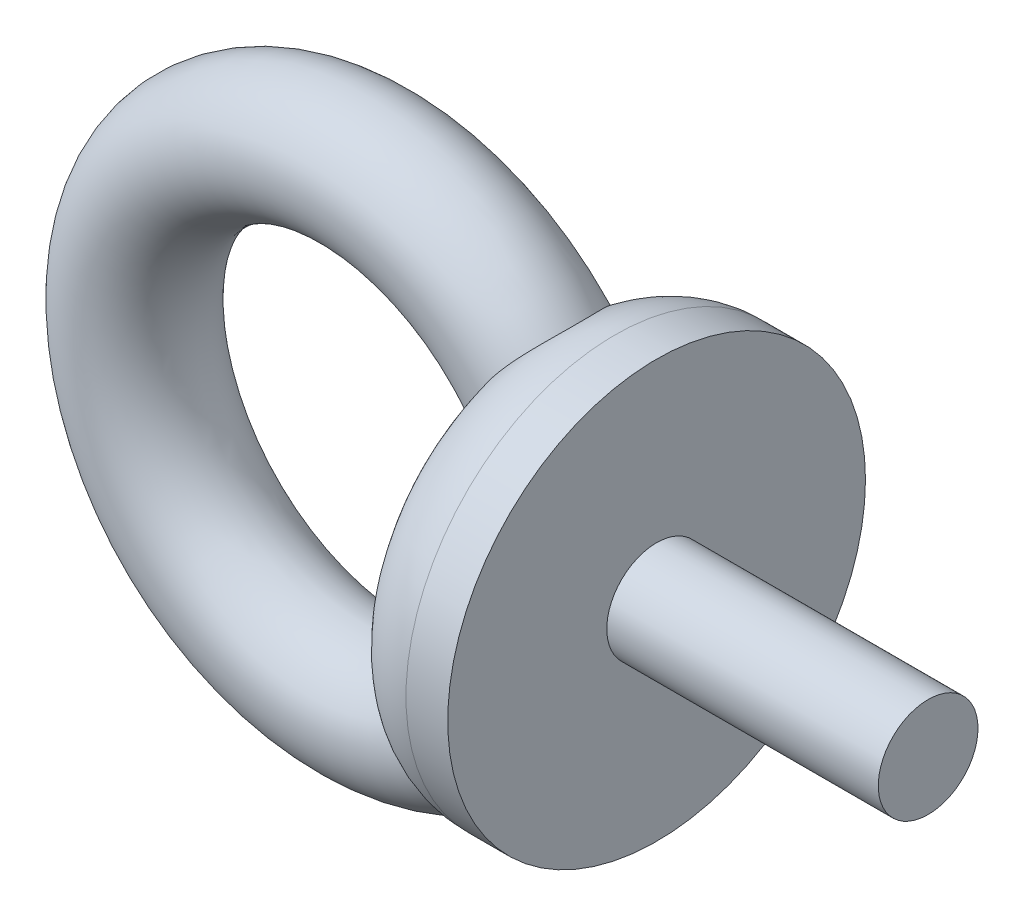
ISO-10303-21;
HEADER;
FILE_DESCRIPTION(('STEP AP214'),'2;1');
FILE_NAME('part.step','',(''),(''),'','','');
FILE_SCHEMA(('AUTOMOTIVE_DESIGN { 1 0 10303 214 1 1 1 1 }'));
ENDSEC;
DATA;
#1=APPLICATION_CONTEXT('core data for automotive mechanical design processes');
#2=APPLICATION_PROTOCOL_DEFINITION('international standard','automotive_design',2000,#1);
#3=PRODUCT_CONTEXT('',#1,'mechanical');
#4=PRODUCT('Part','Part','',(#3));
#5=PRODUCT_RELATED_PRODUCT_CATEGORY('part','',(#4));
#6=PRODUCT_DEFINITION_FORMATION('','',#4);
#7=PRODUCT_DEFINITION_CONTEXT('part definition',#1,'design');
#8=PRODUCT_DEFINITION('design','',#6,#7);
#9=PRODUCT_DEFINITION_SHAPE('','',#8);
#10=(LENGTH_UNIT() NAMED_UNIT(*) SI_UNIT(.MILLI.,.METRE.));
#11=(NAMED_UNIT(*) PLANE_ANGLE_UNIT() SI_UNIT($,.RADIAN.));
#12=(NAMED_UNIT(*) SI_UNIT($,.STERADIAN.) SOLID_ANGLE_UNIT());
#13=UNCERTAINTY_MEASURE_WITH_UNIT(LENGTH_MEASURE(1.E-05),#10,'distance_accuracy_value','');
#14=(GEOMETRIC_REPRESENTATION_CONTEXT(3) GLOBAL_UNCERTAINTY_ASSIGNED_CONTEXT((#13)) GLOBAL_UNIT_ASSIGNED_CONTEXT((#10,
#11,#12)) REPRESENTATION_CONTEXT('',''));
#15=CARTESIAN_POINT('',(0.,0.,0.));
#16=DIRECTION('',(0.,0.,1.));
#17=DIRECTION('',(1.,0.,0.));
#18=AXIS2_PLACEMENT_3D('',#15,#16,#17);
#19=CARTESIAN_POINT('',(0.,0.,0.));
#20=DIRECTION('',(0.,0.,-1.));
#21=DIRECTION('',(-1.,0.,0.));
#22=AXIS2_PLACEMENT_3D('',#19,#20,#21);
#23=TOROIDAL_SURFACE('',#22,11.,3.);
#24=CARTESIAN_POINT('',(8.,0.,0.));
#25=CARTESIAN_POINT('',(8.,0.85634513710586,-0.524401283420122));
#26=CARTESIAN_POINT('',(8.,1.28782894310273,-0.77932871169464));
#27=CARTESIAN_POINT('',(8.,2.00886347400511,-1.20532726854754));
#28=CARTESIAN_POINT('',(8.,2.59707188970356,-1.51559768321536));
#29=CARTESIAN_POINT('',(8.,3.31819010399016,-1.89597586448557));
#30=CARTESIAN_POINT('',(8.,3.94958075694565,-2.16454104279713));
#31=CARTESIAN_POINT('',(8.,4.68032640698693,-2.4753673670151));
#32=CARTESIAN_POINT('',(8.,5.37210425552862,-2.67217062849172));
#33=B_SPLINE_CURVE_WITH_KNOTS('',2,(#24,#25,#26,#27,#28,#29,#30,#31,#32),.UNSPECIFIED.,.F.,.F.,
(3,2,2,2,3),(0.,0.25,0.5,0.75,1.),.UNSPECIFIED.);
#34=CARTESIAN_POINT('',(8.,0.,0.));
#35=VERTEX_POINT('',#34);
#36=CARTESIAN_POINT('',(8.,5.37210425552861,-2.67217062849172));
#37=VERTEX_POINT('',#36);
#38=EDGE_CURVE('E151',#35,#37,#33,.T.);
#39=ORIENTED_EDGE('',*,*,#38,.F.);
#40=CARTESIAN_POINT('',(8.,5.37210425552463,2.67217062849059));
#41=CARTESIAN_POINT('',(8.,4.69332318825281,2.47906480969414));
#42=CARTESIAN_POINT('',(8.,3.96136122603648,2.16862069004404));
#43=CARTESIAN_POINT('',(8.,3.31947365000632,1.89637946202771));
#44=CARTESIAN_POINT('',(8.,2.6021967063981,1.5182999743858));
#45=CARTESIAN_POINT('',(8.,2.01320557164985,1.20784043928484));
#46=CARTESIAN_POINT('',(8.,1.28910346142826,0.780081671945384));
#47=CARTESIAN_POINT('',(8.,1.0016041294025,0.610243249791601));
#48=CARTESIAN_POINT('',(8.,0.642981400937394,0.392580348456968));
#49=CARTESIAN_POINT('',(8.,0.428795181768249,0.262581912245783));
#50=CARTESIAN_POINT('',(8.,0.,0.));
#51=B_SPLINE_CURVE_WITH_KNOTS('',2,(#40,#41,#42,#43,#44,#45,#46,#47,#48,#49,#50),.UNSPECIFIED.,
.F.,.F.,(3,2,2,2,2,3),(0.,0.25,0.5,0.75,0.875,1.),.UNSPECIFIED.);
#52=CARTESIAN_POINT('',(8.,5.37210425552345,2.67217062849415));
#53=VERTEX_POINT('',#52);
#54=EDGE_CURVE('E148',#53,#35,#51,.T.);
#55=ORIENTED_EDGE('',*,*,#54,.F.);
#56=CARTESIAN_POINT('',(8.,5.37210425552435,2.67217062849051));
#57=CARTESIAN_POINT('',(7.99998885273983,5.43690624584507,2.690605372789));
#58=CARTESIAN_POINT('',(8.00162054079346,5.50171347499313,2.70903674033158));
#59=CARTESIAN_POINT('',(8.00820594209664,5.63192295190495,2.74558258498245));
#60=CARTESIAN_POINT('',(8.01319149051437,5.69732492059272,2.7636923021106));
#61=CARTESIAN_POINT('',(8.0266067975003,5.82889383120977,2.79913573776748));
#62=CARTESIAN_POINT('',(8.03507973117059,5.89505987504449,2.81645659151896));
#63=CARTESIAN_POINT('',(8.05554604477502,6.02829410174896,2.84981806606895));
#64=CARTESIAN_POINT('',(8.0675923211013,6.09536024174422,2.86583447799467));
#65=CARTESIAN_POINT('',(8.09458871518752,6.22708064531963,2.89528562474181));
#66=CARTESIAN_POINT('',(8.10943048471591,6.29174178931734,2.90878786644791));
#67=CARTESIAN_POINT('',(8.13406435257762,6.38878090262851,2.92731754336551));
#68=CARTESIAN_POINT('',(8.14271607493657,6.42128439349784,2.93322991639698));
#69=CARTESIAN_POINT('',(8.16084251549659,6.4864143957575,2.94443726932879));
#70=CARTESIAN_POINT('',(8.17032243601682,6.5190402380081,2.94972777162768));
#71=CARTESIAN_POINT('',(8.19010691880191,6.58440983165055,2.95962967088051));
#72=CARTESIAN_POINT('',(8.20041698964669,6.61715270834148,2.96423583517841));
#73=CARTESIAN_POINT('',(8.22186095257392,6.68274987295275,2.97270632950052));
#74=CARTESIAN_POINT('',(8.23300061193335,6.7156030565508,2.97656463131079));
#75=CARTESIAN_POINT('',(8.25610143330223,6.7814104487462,2.98347540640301));
#76=CARTESIAN_POINT('',(8.26806857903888,6.81436327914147,2.98652101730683));
#77=CARTESIAN_POINT('',(8.29281847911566,6.88035703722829,2.99174135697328));
#78=CARTESIAN_POINT('',(8.30560737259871,6.91339627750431,2.99390835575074));
#79=CARTESIAN_POINT('',(8.33106923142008,6.97721545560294,2.99718612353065));
#80=CARTESIAN_POINT('',(8.34370068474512,7.00800904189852,2.99835380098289));
#81=CARTESIAN_POINT('',(8.36967755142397,7.06967758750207,2.99982531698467));
#82=CARTESIAN_POINT('',(8.38302883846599,7.10055028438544,3.00012040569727));
#83=CARTESIAN_POINT('',(8.41043420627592,7.16235823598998,2.99978911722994));
#84=CARTESIAN_POINT('',(8.42449410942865,7.19329085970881,2.9991532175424));
#85=CARTESIAN_POINT('',(8.45330490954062,7.25519621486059,2.99690202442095));
#86=CARTESIAN_POINT('',(8.46806154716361,7.28616590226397,2.99527643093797));
#87=CARTESIAN_POINT('',(8.49825143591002,7.34811971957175,2.9909877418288));
#88=CARTESIAN_POINT('',(8.51369029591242,7.37910035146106,2.98831356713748));
#89=CARTESIAN_POINT('',(8.54522799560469,7.44104699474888,2.98186964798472));
#90=CARTESIAN_POINT('',(8.56133226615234,7.47200901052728,2.97808804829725));
#91=CARTESIAN_POINT('',(8.59418193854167,7.53388560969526,2.96937146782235));
#92=CARTESIAN_POINT('',(8.61093254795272,7.56479565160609,2.96442386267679));
#93=CARTESIAN_POINT('',(8.64505269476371,7.62653275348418,2.95331795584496));
#94=CARTESIAN_POINT('',(8.66242715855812,7.65735468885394,2.94714627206));
#95=CARTESIAN_POINT('',(8.69593390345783,7.71567142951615,2.93424397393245));
#96=CARTESIAN_POINT('',(8.71203168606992,7.74320938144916,2.92761850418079));
#97=CARTESIAN_POINT('',(8.7447683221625,7.79830074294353,2.91326936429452));
#98=CARTESIAN_POINT('',(8.76141171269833,7.82584731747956,2.90552978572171));
#99=CARTESIAN_POINT('',(8.79521282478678,7.88092100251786,2.88889815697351));
#100=CARTESIAN_POINT('',(8.81237451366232,7.90844069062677,2.87998958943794));
#101=CARTESIAN_POINT('',(8.84718391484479,7.96342200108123,2.86096633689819));
#102=CARTESIAN_POINT('',(8.86483500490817,7.99087557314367,2.85083456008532));
#103=CARTESIAN_POINT('',(8.90059190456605,8.04568270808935,2.82931227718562));
#104=CARTESIAN_POINT('',(8.91870046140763,8.07302755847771,2.81790414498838));
#105=CARTESIAN_POINT('',(8.95533820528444,8.12757188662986,2.79377781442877));
#106=CARTESIAN_POINT('',(8.97386947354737,8.1547619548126,2.78104149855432));
#107=CARTESIAN_POINT('',(9.01131580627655,8.20894756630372,2.75420909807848));
#108=CARTESIAN_POINT('',(9.03023225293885,8.23593296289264,2.7400944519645));
#109=CARTESIAN_POINT('',(9.06840841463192,8.28965763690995,2.71045748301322));
#110=CARTESIAN_POINT('',(9.08766876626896,8.31638601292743,2.69491620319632));
#111=CARTESIAN_POINT('',(9.12375534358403,8.36579088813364,2.66467411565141));
#112=CARTESIAN_POINT('',(9.1405823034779,8.38855337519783,2.65011438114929));
#113=CARTESIAN_POINT('',(9.17459153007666,8.43404588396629,2.61973812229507));
#114=CARTESIAN_POINT('',(9.19177272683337,8.45676225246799,2.60389994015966));
#115=CARTESIAN_POINT('',(9.22644574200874,8.50211374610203,2.57091487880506));
#116=CARTESIAN_POINT('',(9.24393542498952,8.5247345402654,2.55374605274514));
#117=CARTESIAN_POINT('',(9.27917838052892,8.56984204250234,2.5180493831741));
#118=CARTESIAN_POINT('',(9.29692846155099,8.59231369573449,2.49949936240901));
#119=CARTESIAN_POINT('',(9.33264143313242,8.63706646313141,2.46099226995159));
#120=CARTESIAN_POINT('',(9.35060005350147,8.65933176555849,2.44101286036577));
#121=CARTESIAN_POINT('',(9.38667578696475,8.70361172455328,2.39960155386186));
#122=CARTESIAN_POINT('',(9.40478753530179,8.72560978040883,2.37814722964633));
#123=CARTESIAN_POINT('',(9.44111180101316,8.76929102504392,2.33374384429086));
#124=CARTESIAN_POINT('',(9.45931784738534,8.79095678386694,2.3107723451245));
#125=CARTESIAN_POINT('',(9.4957684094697,8.83390702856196,2.26329553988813));
#126=CARTESIAN_POINT('',(9.51400531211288,8.85517325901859,2.23876785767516));
#127=CARTESIAN_POINT('',(9.54688177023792,8.89312368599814,2.19310785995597));
#128=CARTESIAN_POINT('',(9.56158683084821,8.90995277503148,2.17214277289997));
#129=CARTESIAN_POINT('',(9.5912207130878,8.94360289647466,2.12875474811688));
#130=CARTESIAN_POINT('',(9.60613819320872,8.96040133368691,2.10630652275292));
#131=CARTESIAN_POINT('',(9.63612758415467,8.99392246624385,2.05989927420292));
#132=CARTESIAN_POINT('',(9.65118646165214,9.01062170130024,2.03591488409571));
#133=CARTESIAN_POINT('',(9.68138565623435,9.04387125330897,1.98638504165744));
#134=CARTESIAN_POINT('',(9.6965112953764,9.06039714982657,1.96081424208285));
#135=CARTESIAN_POINT('',(9.72676568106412,9.09322216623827,1.90806518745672));
#136=CARTESIAN_POINT('',(9.7418780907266,9.10949584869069,1.88086173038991));
#137=CARTESIAN_POINT('',(9.77202258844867,9.14173382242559,1.82480537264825));
#138=CARTESIAN_POINT('',(9.78703667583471,9.15767160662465,1.79592754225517));
#139=CARTESIAN_POINT('',(9.81689640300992,9.18914966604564,1.73648595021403));
#140=CARTESIAN_POINT('',(9.83172238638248,9.20466229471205,1.70589767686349));
#141=CARTESIAN_POINT('',(9.86111091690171,9.23519971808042,1.64300393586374));
#142=CARTESIAN_POINT('',(9.8756520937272,9.25019576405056,1.61067449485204));
#143=CARTESIAN_POINT('',(9.90002014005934,9.27513504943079,1.55434985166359));
#144=CARTESIAN_POINT('',(9.91003183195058,9.28532210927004,1.53054186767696));
#145=CARTESIAN_POINT('',(9.93032285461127,9.30586605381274,1.48085532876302));
#146=CARTESIAN_POINT('',(9.94057179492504,9.31618483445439,1.45494856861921));
#147=CARTESIAN_POINT('',(9.96122025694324,9.33688283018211,1.40100324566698));
#148=CARTESIAN_POINT('',(9.97158569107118,9.34722175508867,1.37293617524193));
#149=CARTESIAN_POINT('',(9.99234126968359,9.36783960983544,1.31461281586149));
#150=CARTESIAN_POINT('',(10.0026937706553,9.37807578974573,1.28432800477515));
#151=CARTESIAN_POINT('',(10.0232867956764,9.39835771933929,1.22151811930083));
#152=CARTESIAN_POINT('',(10.0334861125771,9.40835810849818,1.18896487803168));
#153=CARTESIAN_POINT('',(10.0536236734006,9.42802974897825,1.12157507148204));
#154=CARTESIAN_POINT('',(10.0635170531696,9.43765300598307,1.08671107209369));
#155=CARTESIAN_POINT('',(10.0828898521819,9.45641391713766,1.0146674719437));
#156=CARTESIAN_POINT('',(10.0923211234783,9.4655004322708,0.977461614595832));
#157=CARTESIAN_POINT('',(10.1105775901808,9.48305263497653,0.900712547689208));
#158=CARTESIAN_POINT('',(10.1193499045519,9.49146555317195,0.861144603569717));
#159=CARTESIAN_POINT('',(10.131830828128,9.50326825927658,0.80079980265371));
#160=CARTESIAN_POINT('',(10.1359359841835,9.50711908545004,0.780193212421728));
#161=CARTESIAN_POINT('',(10.144055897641,9.51474155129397,0.737636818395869));
#162=CARTESIAN_POINT('',(10.1480508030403,9.51849490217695,0.715679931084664));
#163=CARTESIAN_POINT('',(10.1570216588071,9.52691970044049,0.663897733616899));
#164=CARTESIAN_POINT('',(10.1618479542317,9.53144926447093,0.634023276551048));
#165=CARTESIAN_POINT('',(10.172001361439,9.54097855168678,0.566283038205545));
#166=CARTESIAN_POINT('',(10.1771317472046,9.54579367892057,0.528361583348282));
#167=CARTESIAN_POINT('',(10.1872724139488,9.55531030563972,0.444417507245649));
#168=CARTESIAN_POINT('',(10.192039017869,9.55978291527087,0.398339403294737));
#169=CARTESIAN_POINT('',(10.2006861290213,9.56789642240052,0.298015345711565));
#170=CARTESIAN_POINT('',(10.2042752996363,9.57126390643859,0.243721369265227));
#171=CARTESIAN_POINT('',(10.2081751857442,9.57492266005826,0.159164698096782));
#172=CARTESIAN_POINT('',(10.209234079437,9.57591600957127,0.12896289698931));
#173=CARTESIAN_POINT('',(10.2107334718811,9.57732245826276,0.0665378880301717));
#174=CARTESIAN_POINT('',(10.2111286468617,9.57769303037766,0.0343125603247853));
#175=CARTESIAN_POINT('',(10.211161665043,9.5777236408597,-0.0304141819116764));
#176=CARTESIAN_POINT('',(10.2107930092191,9.57737758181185,-0.0629156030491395));
#177=CARTESIAN_POINT('',(10.2093328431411,9.57600730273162,-0.125855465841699));
#178=CARTESIAN_POINT('',(10.2082879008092,9.57502677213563,-0.156296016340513));
#179=CARTESIAN_POINT('',(10.2044153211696,9.57139296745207,-0.241455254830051));
#180=CARTESIAN_POINT('',(10.2008302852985,9.56802903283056,-0.29611324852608));
#181=CARTESIAN_POINT('',(10.1921723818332,9.55990513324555,-0.397011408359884));
#182=CARTESIAN_POINT('',(10.1873981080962,9.5554253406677,-0.443300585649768));
#183=CARTESIAN_POINT('',(10.1772440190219,9.54589641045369,-0.527514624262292));
#184=CARTESIAN_POINT('',(10.1721133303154,9.54108123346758,-0.56549609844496));
#185=CARTESIAN_POINT('',(10.1619764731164,9.5315685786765,-0.633207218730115));
#186=CARTESIAN_POINT('',(10.1571707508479,9.52705904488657,-0.662993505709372));
#187=CARTESIAN_POINT('',(10.1482686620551,9.51869997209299,-0.714453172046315));
#188=CARTESIAN_POINT('',(10.1443238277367,9.51499412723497,-0.736176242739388));
#189=CARTESIAN_POINT('',(10.1364385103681,9.50759518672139,-0.777593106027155));
#190=CARTESIAN_POINT('',(10.1325280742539,9.50392955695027,-0.797297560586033));
#191=CARTESIAN_POINT('',(10.1203057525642,9.49237932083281,-0.85671677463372));
#192=CARTESIAN_POINT('',(10.1115876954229,9.48401865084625,-0.896257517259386));
#193=CARTESIAN_POINT('',(10.0934381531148,9.46657332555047,-0.972953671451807));
#194=CARTESIAN_POINT('',(10.0840596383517,9.45754134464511,-1.01013369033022));
#195=CARTESIAN_POINT('',(10.0647923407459,9.43888992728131,-1.08212697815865));
#196=CARTESIAN_POINT('',(10.0549517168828,9.42932161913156,-1.11696637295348));
#197=CARTESIAN_POINT('',(10.0349191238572,9.40976064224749,-1.18430809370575));
#198=CARTESIAN_POINT('',(10.02477205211,9.39981593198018,-1.21683772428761));
#199=CARTESIAN_POINT('',(10.0042829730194,9.3796459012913,-1.27960127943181));
#200=CARTESIAN_POINT('',(9.99398220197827,9.36946590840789,-1.30986324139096));
#201=CARTESIAN_POINT('',(9.97332940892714,9.34896089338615,-1.36814154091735));
#202=CARTESIAN_POINT('',(9.96301506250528,9.33867858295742,-1.3961862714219));
#203=CARTESIAN_POINT('',(9.94246801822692,9.31809416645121,-1.45008728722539));
#204=CARTESIAN_POINT('',(9.93226944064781,9.3078323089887,-1.47597195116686));
#205=CARTESIAN_POINT('',(9.91207825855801,9.28740249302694,-1.52561439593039));
#206=CARTESIAN_POINT('',(9.90211608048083,9.27727259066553,-1.54940025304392));
#207=CARTESIAN_POINT('',(9.87786734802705,9.25247268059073,-1.60567465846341));
#208=CARTESIAN_POINT('',(9.8633962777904,9.23755986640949,-1.63797739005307));
#209=CARTESIAN_POINT('',(9.8341467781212,9.20719017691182,-1.70082475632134));
#210=CARTESIAN_POINT('',(9.81938968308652,9.19176192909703,-1.73139318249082));
#211=CARTESIAN_POINT('',(9.78966609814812,9.16045349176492,-1.79080177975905));
#212=CARTESIAN_POINT('',(9.77471924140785,9.14460083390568,-1.81966628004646));
#213=CARTESIAN_POINT('',(9.74470719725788,9.11253355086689,-1.87570230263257));
#214=CARTESIAN_POINT('',(9.72965999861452,9.09634532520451,-1.90289857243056));
#215=CARTESIAN_POINT('',(9.69953368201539,9.06369128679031,-1.95563917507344));
#216=CARTESIAN_POINT('',(9.68447090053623,9.0472508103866,-1.98120852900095));
#217=CARTESIAN_POINT('',(9.65439475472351,9.01417183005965,-2.03074097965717));
#218=CARTESIAN_POINT('',(9.63939607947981,8.99755765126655,-2.05472924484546));
#219=CARTESIAN_POINT('',(9.60952417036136,8.96420604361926,-2.10114930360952));
#220=CARTESIAN_POINT('',(9.59466399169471,8.947491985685,-2.12360628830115));
#221=CARTESIAN_POINT('',(9.56514148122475,8.91400983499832,-2.16701644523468));
#222=CARTESIAN_POINT('',(9.55049052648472,8.89726425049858,-2.18799473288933));
#223=CARTESIAN_POINT('',(9.51768115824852,8.85944159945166,-2.23376082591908));
#224=CARTESIAN_POINT('',(9.49945579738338,8.83821753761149,-2.25837952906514));
#225=CARTESIAN_POINT('',(9.46302469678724,8.79534865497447,-2.30603654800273));
#226=CARTESIAN_POINT('',(9.44482665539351,8.77372215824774,-2.32909724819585));
#227=CARTESIAN_POINT('',(9.40851494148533,8.73011673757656,-2.373677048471));
#228=CARTESIAN_POINT('',(9.39040782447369,8.70815530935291,-2.39521859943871));
#229=CARTESIAN_POINT('',(9.35433815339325,8.66394609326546,-2.43680222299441));
#230=CARTESIAN_POINT('',(9.33638104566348,8.64171497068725,-2.45686674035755));
#231=CARTESIAN_POINT('',(9.30066812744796,8.59702825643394,-2.49554178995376));
#232=CARTESIAN_POINT('',(9.28291666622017,8.57458853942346,-2.51417468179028));
#233=CARTESIAN_POINT('',(9.24766819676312,8.52954280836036,-2.55003473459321));
#234=CARTESIAN_POINT('',(9.23017445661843,8.50695191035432,-2.56728409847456));
#235=CARTESIAN_POINT('',(9.19549081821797,8.4616582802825,-2.60042779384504));
#236=CARTESIAN_POINT('',(9.17830312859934,8.43896993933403,-2.61634410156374));
#237=CARTESIAN_POINT('',(9.14427851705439,8.3935318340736,-2.64687411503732));
#238=CARTESIAN_POINT('',(9.12744273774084,8.37079577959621,-2.66150951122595));
#239=CARTESIAN_POINT('',(9.09128276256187,8.32137490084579,-2.69195699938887));
#240=CARTESIAN_POINT('',(9.07195740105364,8.29460183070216,-2.70762475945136));
#241=CARTESIAN_POINT('',(9.03365018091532,8.24078285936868,-2.73750505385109));
#242=CARTESIAN_POINT('',(9.01466772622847,8.21374798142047,-2.75173669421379));
#243=CARTESIAN_POINT('',(8.97708869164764,8.15945917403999,-2.77879365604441));
#244=CARTESIAN_POINT('',(8.95849076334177,8.13221550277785,-2.79163768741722));
#245=CARTESIAN_POINT('',(8.92171948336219,8.07756027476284,-2.8159702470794));
#246=CARTESIAN_POINT('',(8.90354407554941,8.05015823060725,-2.82747704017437));
#247=CARTESIAN_POINT('',(8.86765366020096,7.99523354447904,-2.84918770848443));
#248=CARTESIAN_POINT('',(8.84993592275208,7.96771970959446,-2.85940935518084));
#249=CARTESIAN_POINT('',(8.81499378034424,7.91261520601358,-2.87860370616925));
#250=CARTESIAN_POINT('',(8.79776600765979,7.88503267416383,-2.88759364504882));
#251=CARTESIAN_POINT('',(8.76383366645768,7.82983106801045,-2.90437969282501));
#252=CARTESIAN_POINT('',(8.74712513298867,7.80221949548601,-2.91219245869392));
#253=CARTESIAN_POINT('',(8.71425932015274,7.74699640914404,-2.92668000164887));
#254=CARTESIAN_POINT('',(8.69809750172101,7.71939180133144,-2.93337082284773));
#255=CARTESIAN_POINT('',(8.66449412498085,7.66099640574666,-2.94638915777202));
#256=CARTESIAN_POINT('',(8.64708627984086,7.63016312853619,-2.95261337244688));
#257=CARTESIAN_POINT('',(8.61289883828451,7.56840027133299,-2.96382096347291));
#258=CARTESIAN_POINT('',(8.59611433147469,7.53747583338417,-2.96881772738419));
#259=CARTESIAN_POINT('',(8.56319627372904,7.47556767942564,-2.97762920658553));
#260=CARTESIAN_POINT('',(8.54705753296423,7.44458851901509,-2.98145655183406));
#261=CARTESIAN_POINT('',(8.51545043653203,7.38260500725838,-2.98798850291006));
#262=CARTESIAN_POINT('',(8.49997666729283,7.35160466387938,-2.99070496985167));
#263=CARTESIAN_POINT('',(8.46971658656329,7.28960905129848,-2.99507476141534));
#264=CARTESIAN_POINT('',(8.45492468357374,7.25861729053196,-2.99673917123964));
#265=CARTESIAN_POINT('',(8.42604305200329,7.19666561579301,-2.99906450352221));
#266=CARTESIAN_POINT('',(8.4119476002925,7.16570875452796,-2.99973573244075));
#267=CARTESIAN_POINT('',(8.38447097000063,7.10385032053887,-3.00013418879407));
#268=CARTESIAN_POINT('',(8.37108398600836,7.07295138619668,-2.99987094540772));
#269=CARTESIAN_POINT('',(8.34503543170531,7.01122862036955,-2.99845963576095));
#270=CARTESIAN_POINT('',(8.3323680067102,6.98040705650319,-2.99732032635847));
#271=CARTESIAN_POINT('',(8.3068348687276,6.91653495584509,-2.99409823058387));
#272=CARTESIAN_POINT('',(8.29401057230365,6.88347072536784,-2.99195850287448));
#273=CARTESIAN_POINT('',(8.26919081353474,6.81742438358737,-2.98678924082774));
#274=CARTESIAN_POINT('',(8.25718923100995,6.78444396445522,-2.9837674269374));
#275=CARTESIAN_POINT('',(8.23402029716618,6.71857906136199,-2.97690080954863));
#276=CARTESIAN_POINT('',(8.22284698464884,6.68569595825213,-2.97306285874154));
#277=CARTESIAN_POINT('',(8.20133656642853,6.62003677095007,-2.96462967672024));
#278=CARTESIAN_POINT('',(8.19099371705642,6.58726179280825,-2.96004046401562));
#279=CARTESIAN_POINT('',(8.17114451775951,6.52182598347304,-2.95016912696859));
#280=CARTESIAN_POINT('',(8.16163268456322,6.48916602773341,-2.94489222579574));
#281=CARTESIAN_POINT('',(8.14344334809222,6.42396591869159,-2.93370880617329));
#282=CARTESIAN_POINT('',(8.1347606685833,6.39142643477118,-2.92780675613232));
#283=CARTESIAN_POINT('',(8.11003470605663,6.29427500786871,-2.90930269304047));
#284=CARTESIAN_POINT('',(8.09513327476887,6.22953682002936,-2.89581131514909));
#285=CARTESIAN_POINT('',(8.06799774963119,6.09754067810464,-2.86634538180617));
#286=CARTESIAN_POINT('',(8.05587810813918,6.03027541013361,-2.85029927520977));
#287=CARTESIAN_POINT('',(8.03528808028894,5.89664392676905,-2.8168651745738));
#288=CARTESIAN_POINT('',(8.02676447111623,5.83027978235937,-2.79950159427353));
#289=CARTESIAN_POINT('',(8.01326919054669,5.69831513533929,-2.76396390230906));
#290=CARTESIAN_POINT('',(8.00825414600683,5.63271553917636,-2.74580274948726));
#291=CARTESIAN_POINT('',(8.0016298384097,5.50211006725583,-2.70914926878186));
#292=CARTESIAN_POINT('',(7.99998867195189,5.4371044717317,-2.69066172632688));
#293=CARTESIAN_POINT('',(8.00000000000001,5.37210425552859,-2.67217062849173));
#294=B_SPLINE_CURVE_WITH_KNOTS('',3,(#56,#57,#58,#59,#60,#61,#62,#63,#64,#65,#66,#67,#68,#69,
#70,#71,#72,#73,#74,#75,#76,#77,#78,#79,#80,#81,#82,#83,#84,#85,#86,#87,#88,#89,#90,#91,#92,#93,
#94,#95,#96,#97,#98,#99,#100,#101,#102,#103,#104,#105,#106,#107,#108,#109,#110,#111,#112,#113,
#114,#115,#116,#117,#118,#119,#120,#121,#122,#123,#124,#125,#126,#127,#128,#129,#130,#131,#132,
#133,#134,#135,#136,#137,#138,#139,#140,#141,#142,#143,#144,#145,#146,#147,#148,#149,#150,#151,
#152,#153,#154,#155,#156,#157,#158,#159,#160,#161,#162,#163,#164,#165,#166,#167,#168,#169,#170,
#171,#172,#173,#174,#175,#176,#177,#178,#179,#180,#181,#182,#183,#184,#185,#186,#187,#188,#189,
#190,#191,#192,#193,#194,#195,#196,#197,#198,#199,#200,#201,#202,#203,#204,#205,#206,#207,#208,
#209,#210,#211,#212,#213,#214,#215,#216,#217,#218,#219,#220,#221,#222,#223,#224,#225,#226,#227,
#228,#229,#230,#231,#232,#233,#234,#235,#236,#237,#238,#239,#240,#241,#242,#243,#244,#245,#246,
#247,#248,#249,#250,#251,#252,#253,#254,#255,#256,#257,#258,#259,#260,#261,#262,#263,#264,#265,
#266,#267,#268,#269,#270,#271,#272,#273,#274,#275,#276,#277,#278,#279,#280,#281,#282,#283,#284,
#285,#286,#287,#288,#289,#290,#291,#292,#293),.UNSPECIFIED.,.F.,.F.,(4,2,2,2,2,2,2,2,2,2,2,2,2,
2,2,2,2,2,2,2,2,2,2,2,2,2,2,2,2,2,2,2,2,2,2,2,2,2,2,2,2,2,2,2,2,2,2,2,2,2,2,2,2,2,2,2,2,2,2,2,2,
2,2,2,2,2,2,2,2,2,2,2,2,2,2,2,2,2,2,2,2,2,2,2,2,2,2,2,2,2,2,2,2,2,2,2,2,2,2,2,2,2,2,2,2,2,2,2,2,
2,2,2,2,2,2,2,2,2,4),(0.,0.202105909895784,0.406157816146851,0.612815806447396,
0.822700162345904,1.02569222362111,1.12813255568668,1.23127035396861,1.33516013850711,
1.43985536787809,1.54540851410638,1.65187114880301,1.75176657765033,1.85266036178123,
1.95459336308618,2.05760579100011,2.1617372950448,2.26702705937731,2.37351389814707,
2.48123635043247,2.57895417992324,2.67823917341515,2.77911922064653,2.88162151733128,
2.98577265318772,3.0915986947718,3.1991252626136,3.3083776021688,3.40385564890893,
3.50160495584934,3.60164085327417,3.70397795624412,3.80863024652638,3.91561114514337,
4.0249335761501,4.13661002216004,4.22852437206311,4.32378470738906,4.4223967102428,
4.52436558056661,4.6296961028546,4.73839270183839,4.85045948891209,4.96590030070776,
5.04918178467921,5.13829795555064,5.23324975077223,5.3340379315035,5.44066312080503,
5.5531258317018,5.67142648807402,5.79556544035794,5.85964580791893,5.92753231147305,
6.01931479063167,6.13499178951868,6.2745614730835,6.43802162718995,6.52872015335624,
6.62539247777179,6.72289071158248,6.81430171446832,6.9788462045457,7.11904662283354,
7.23490065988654,7.32640640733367,7.39356235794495,7.4548201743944,7.57881487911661,
7.69696719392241,7.80927745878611,7.91574608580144,8.01637357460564,8.11116053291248,
8.20010770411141,8.28321600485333,8.39841320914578,8.51024456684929,8.61871384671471,
8.723825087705,8.82558263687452,8.92399119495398,9.01905587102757,9.11078224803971,
9.22254966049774,9.33195904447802,9.43902281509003,9.54375382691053,9.64616542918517,
9.74627152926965,9.84408666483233,9.93962608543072,10.0492418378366,10.1571228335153,
10.26329447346,10.3677825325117,10.4706132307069,10.5718133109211,10.6714101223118,
10.7694317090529,10.8772589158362,10.983851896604,11.0892492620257,11.1934898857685,
11.2966129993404,11.3986582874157,11.4996659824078,11.5996769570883,11.7062426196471,
11.8119021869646,11.9167073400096,12.0207106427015,12.1239656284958,12.2265268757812,
12.4297720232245,12.6402859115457,12.8475644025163,13.0522329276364,13.2549570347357),.UNSPECIFIED.);
#295=EDGE_CURVE('E11',#53,#37,#294,.T.);
#296=ORIENTED_EDGE('',*,*,#295,.T.);
#297=EDGE_LOOP('',(#39,#55,#296));
#298=FACE_BOUND('',#297,.T.);
#299=CARTESIAN_POINT('',(8.,0.,0.));
#300=CARTESIAN_POINT('',(8.,-0.856345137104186,0.524401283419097));
#301=CARTESIAN_POINT('',(8.,-1.28782894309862,0.779328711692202));
#302=CARTESIAN_POINT('',(8.,-2.00886347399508,1.20532726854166));
#303=CARTESIAN_POINT('',(8.,-2.59707188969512,1.5155976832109));
#304=CARTESIAN_POINT('',(8.,-3.31819010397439,1.89597586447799));
#305=CARTESIAN_POINT('',(8.,-3.94958075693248,2.16454104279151));
#306=CARTESIAN_POINT('',(8.,-4.68032640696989,2.47536736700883));
#307=CARTESIAN_POINT('',(8.,-5.37210425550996,2.67217062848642));
#308=B_SPLINE_CURVE_WITH_KNOTS('',2,(#299,#300,#301,#302,#303,#304,#305,#306,#307),
.UNSPECIFIED.,.F.,.F.,(3,2,2,2,3),(0.,0.25,0.5,0.75,1.),.UNSPECIFIED.);
#309=CARTESIAN_POINT('',(8.,-5.37210425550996,2.67217062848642));
#310=VERTEX_POINT('',#309);
#311=EDGE_CURVE('E35',#35,#310,#308,.T.);
#312=ORIENTED_EDGE('',*,*,#311,.F.);
#313=CARTESIAN_POINT('',(8.,-5.37210425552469,-2.67217062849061));
#314=CARTESIAN_POINT('',(8.,-4.69332318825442,-2.4790648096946));
#315=CARTESIAN_POINT('',(8.,-3.96136122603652,-2.16862069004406));
#316=CARTESIAN_POINT('',(8.,-3.31947365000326,-1.89637946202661));
#317=CARTESIAN_POINT('',(8.,-2.60219670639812,-1.51829997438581));
#318=CARTESIAN_POINT('',(8.,-2.01320557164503,-1.20784043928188));
#319=CARTESIAN_POINT('',(8.,-1.28910346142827,-0.780081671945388));
#320=CARTESIAN_POINT('',(8.,-1.00160412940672,-0.610243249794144));
#321=CARTESIAN_POINT('',(8.,-0.642981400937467,-0.392580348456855));
#322=CARTESIAN_POINT('',(8.,-0.428795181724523,-0.262581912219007));
#323=CARTESIAN_POINT('',(8.,0.,0.));
#324=B_SPLINE_CURVE_WITH_KNOTS('',2,(#313,#314,#315,#316,#317,#318,#319,#320,#321,#322,#323),
.UNSPECIFIED.,.F.,.F.,(3,2,2,2,2,3),(0.,0.25,0.5,0.75,0.875,1.),.UNSPECIFIED.);
#325=CARTESIAN_POINT('',(8.,-5.37210425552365,-2.67217062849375));
#326=VERTEX_POINT('',#325);
#327=EDGE_CURVE('E155',#326,#35,#324,.T.);
#328=ORIENTED_EDGE('',*,*,#327,.F.);
#329=CARTESIAN_POINT('',(8.00000000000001,-5.37210425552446,-2.67217062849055));
#330=CARTESIAN_POINT('',(7.99998848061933,-5.43745215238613,-2.69076066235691));
#331=CARTESIAN_POINT('',(8.00164758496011,-5.50280550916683,-2.7093471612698));
#332=CARTESIAN_POINT('',(8.00834414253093,-5.63411572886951,-2.74619332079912));
#333=CARTESIAN_POINT('',(8.0134141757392,-5.70007230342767,-2.76444806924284));
#334=CARTESIAN_POINT('',(8.02705773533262,-5.83276274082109,-2.80015977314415));
#335=CARTESIAN_POINT('',(8.03567555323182,-5.8994956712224,-2.81760342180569));
#336=CARTESIAN_POINT('',(8.05649222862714,-6.03387860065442,-2.85117541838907));
#337=CARTESIAN_POINT('',(8.06874539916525,-6.10152647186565,-2.86727869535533));
#338=CARTESIAN_POINT('',(8.09618807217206,-6.2343107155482,-2.8968319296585));
#339=CARTESIAN_POINT('',(8.11126385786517,-6.29945443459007,-2.91035336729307));
#340=CARTESIAN_POINT('',(8.13628206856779,-6.39721534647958,-2.92887207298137));
#341=CARTESIAN_POINT('',(8.14506871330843,-6.42996202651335,-2.93477429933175));
#342=CARTESIAN_POINT('',(8.16347681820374,-6.4955795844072,-2.94594683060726));
#343=CARTESIAN_POINT('',(8.17310361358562,-6.52844976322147,-2.95121250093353));
#344=CARTESIAN_POINT('',(8.19319353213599,-6.59430879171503,-2.96104877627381));
#345=CARTESIAN_POINT('',(8.20366230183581,-6.62729672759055,-2.96561396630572));
#346=CARTESIAN_POINT('',(8.22543512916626,-6.69338429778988,-2.9739851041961));
#347=CARTESIAN_POINT('',(8.23674509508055,-6.7264827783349,-2.97778481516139));
#348=CARTESIAN_POINT('',(8.26019772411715,-6.79278044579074,-2.98455953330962));
#349=CARTESIAN_POINT('',(8.27234651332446,-6.82597819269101,-2.9875274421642));
#350=CARTESIAN_POINT('',(8.297470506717,-6.89246077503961,-2.99257202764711));
#351=CARTESIAN_POINT('',(8.31045199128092,-6.92574384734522,-2.99464071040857));
#352=CARTESIAN_POINT('',(8.33628212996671,-6.98999813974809,-2.99770610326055));
#353=CARTESIAN_POINT('',(8.34908823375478,-7.02098366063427,-2.99876180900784));
#354=CARTESIAN_POINT('',(8.37542288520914,-7.08303667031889,-2.99999111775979));
#355=CARTESIAN_POINT('',(8.38895745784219,-7.1141017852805,-3.00015563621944));
#356=CARTESIAN_POINT('',(8.41673732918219,-7.17629440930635,-2.99954363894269));
#357=CARTESIAN_POINT('',(8.4309885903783,-7.20741915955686,-2.99875724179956));
#358=CARTESIAN_POINT('',(8.46018945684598,-7.26970772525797,-2.99618418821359));
#359=CARTESIAN_POINT('',(8.47514493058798,-7.30086835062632,-2.99438684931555));
#360=CARTESIAN_POINT('',(8.50573916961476,-7.36320201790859,-2.9897325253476));
#361=CARTESIAN_POINT('',(8.52138365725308,-7.39437139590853,-2.98686405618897));
#362=CARTESIAN_POINT('',(8.55333853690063,-7.45669241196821,-2.98000815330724));
#363=CARTESIAN_POINT('',(8.56965445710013,-7.48783986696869,-2.97600843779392));
#364=CARTESIAN_POINT('',(8.6029325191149,-7.55008300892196,-2.96683101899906));
#365=CARTESIAN_POINT('',(8.61989994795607,-7.58117394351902,-2.96164024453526));
#366=CARTESIAN_POINT('',(8.65445787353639,-7.64326719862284,-2.9500222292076));
#367=CARTESIAN_POINT('',(8.67205335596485,-7.6742641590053,-2.94358114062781));
#368=CARTESIAN_POINT('',(8.70595739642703,-7.7328631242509,-2.93015241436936));
#369=CARTESIAN_POINT('',(8.72223125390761,-7.76051012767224,-2.9232732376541));
#370=CARTESIAN_POINT('',(8.75532408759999,-7.81581892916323,-2.90839488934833));
#371=CARTESIAN_POINT('',(8.77214762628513,-7.84347356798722,-2.90037923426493));
#372=CARTESIAN_POINT('',(8.80631199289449,-7.89876152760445,-2.88317239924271));
#373=CARTESIAN_POINT('',(8.82365678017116,-7.92638707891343,-2.87396411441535));
#374=CARTESIAN_POINT('',(8.85883417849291,-7.98157694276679,-2.85431715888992));
#375=CARTESIAN_POINT('',(8.87667012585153,-8.00913283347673,-2.84386079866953));
#376=CARTESIAN_POINT('',(8.9127972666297,-8.06414000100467,-2.8216639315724));
#377=CARTESIAN_POINT('',(8.93109113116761,-8.09158216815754,-2.80990519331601));
#378=CARTESIAN_POINT('',(8.9680986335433,-8.14631497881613,-2.78505116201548));
#379=CARTESIAN_POINT('',(8.98681424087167,-8.17359578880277,-2.77193714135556));
#380=CARTESIAN_POINT('',(9.02462690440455,-8.22795505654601,-2.74432186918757));
#381=CARTESIAN_POINT('',(9.04372519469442,-8.2550229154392,-2.7298014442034));
#382=CARTESIAN_POINT('',(9.08226106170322,-8.30890294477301,-2.6993245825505));
#383=CARTESIAN_POINT('',(9.10169908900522,-8.33570373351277,-2.68334857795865));
#384=CARTESIAN_POINT('',(9.1380545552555,-8.38515599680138,-2.65231928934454));
#385=CARTESIAN_POINT('',(9.15497436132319,-8.40789749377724,-2.63741195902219));
#386=CARTESIAN_POINT('',(9.18916952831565,-8.45334810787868,-2.6063168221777));
#387=CARTESIAN_POINT('',(9.20644352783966,-8.47604298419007,-2.5901066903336));
#388=CARTESIAN_POINT('',(9.2413006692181,-8.52134997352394,-2.55635283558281));
#389=CARTESIAN_POINT('',(9.2588813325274,-8.5439471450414,-2.5387864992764));
#390=CARTESIAN_POINT('',(9.29430294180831,-8.58900412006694,-2.50226878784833));
#391=CARTESIAN_POINT('',(9.31214030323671,-8.61144823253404,-2.48329457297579));
#392=CARTESIAN_POINT('',(9.34802254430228,-8.65614074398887,-2.44391206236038));
#393=CARTESIAN_POINT('',(9.36606271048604,-8.67837266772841,-2.42348077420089));
#394=CARTESIAN_POINT('',(9.40229411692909,-8.7225786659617,-2.38113780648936));
#395=CARTESIAN_POINT('',(9.42047949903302,-8.74453544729,-2.35920305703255));
#396=CARTESIAN_POINT('',(9.45694133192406,-8.78812476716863,-2.31381021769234));
#397=CARTESIAN_POINT('',(9.47521076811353,-8.80973915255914,-2.29032906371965));
#398=CARTESIAN_POINT('',(9.51177599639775,-8.85257500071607,-2.24180379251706));
#399=CARTESIAN_POINT('',(9.53006358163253,-8.87377745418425,-2.21673669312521));
#400=CARTESIAN_POINT('',(9.56283498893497,-8.91138979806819,-2.17033654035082));
#401=CARTESIAN_POINT('',(9.57739136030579,-8.92795523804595,-2.14918040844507));
#402=CARTESIAN_POINT('',(9.60672466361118,-8.96108126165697,-2.1053995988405));
#403=CARTESIAN_POINT('',(9.62148973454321,-8.97761885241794,-2.08274955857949));
#404=CARTESIAN_POINT('',(9.65116995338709,-9.01062053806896,-2.03592793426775));
#405=CARTESIAN_POINT('',(9.6660715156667,-9.0270607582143,-2.01173091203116));
#406=CARTESIAN_POINT('',(9.69595048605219,-9.05979351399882,-1.9617650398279));
#407=CARTESIAN_POINT('',(9.71091263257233,-9.07606119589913,-1.93597077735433));
#408=CARTESIAN_POINT('',(9.74083310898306,-9.10836992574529,-1.88276408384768));
#409=CARTESIAN_POINT('',(9.75577448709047,-9.12438508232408,-1.85532639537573));
#410=CARTESIAN_POINT('',(9.78556857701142,-9.15610498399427,-1.79879099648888));
#411=CARTESIAN_POINT('',(9.80040264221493,-9.17178274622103,-1.76966831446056));
#412=CARTESIAN_POINT('',(9.8298924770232,-9.20273849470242,-1.70972669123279));
#413=CARTESIAN_POINT('',(9.84452791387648,-9.2179883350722,-1.67888321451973));
#414=CARTESIAN_POINT('',(9.87352389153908,-9.24799662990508,-1.61546908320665));
#415=CARTESIAN_POINT('',(9.8878623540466,-9.26272581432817,-1.58287445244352));
#416=CARTESIAN_POINT('',(9.91175963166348,-9.28709002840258,-1.52636570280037));
#417=CARTESIAN_POINT('',(9.92151083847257,-9.29697548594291,-1.50264018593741));
#418=CARTESIAN_POINT('',(9.94128635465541,-9.31692622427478,-1.45308778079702));
#419=CARTESIAN_POINT('',(9.95127951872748,-9.32695292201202,-1.42723288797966));
#420=CARTESIAN_POINT('',(9.97142027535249,-9.34707534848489,-1.37336067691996));
#421=CARTESIAN_POINT('',(9.98153291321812,-9.35713021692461,-1.34531502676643));
#422=CARTESIAN_POINT('',(10.0017849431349,-9.37718672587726,-1.28700403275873));
#423=CARTESIAN_POINT('',(10.0118857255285,-9.38714493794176,-1.2567103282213));
#424=CARTESIAN_POINT('',(10.0319747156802,-9.40687614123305,-1.19385234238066));
#425=CARTESIAN_POINT('',(10.0419206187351,-9.41660301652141,-1.16126005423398));
#426=CARTESIAN_POINT('',(10.0615498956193,-9.43572871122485,-1.09376217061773));
#427=CARTESIAN_POINT('',(10.0711872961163,-9.44507857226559,-1.05882931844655));
#428=CARTESIAN_POINT('',(10.0900369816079,-9.46329854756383,-0.986618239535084));
#429=CARTESIAN_POINT('',(10.0991995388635,-9.47211684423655,-0.949313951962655));
#430=CARTESIAN_POINT('',(10.1169317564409,-9.48910585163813,-0.872339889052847));
#431=CARTESIAN_POINT('',(10.1254482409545,-9.49722150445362,-0.83264566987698));
#432=CARTESIAN_POINT('',(10.1399732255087,-9.5110233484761,-0.759515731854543));
#433=CARTESIAN_POINT('',(10.1461626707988,-9.51688861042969,-0.726149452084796));
#434=CARTESIAN_POINT('',(10.1577060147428,-9.52782360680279,-0.659142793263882));
#435=CARTESIAN_POINT('',(10.1630599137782,-9.53289334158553,-0.625502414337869));
#436=CARTESIAN_POINT('',(10.1729298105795,-9.54222682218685,-0.557987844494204));
#437=CARTESIAN_POINT('',(10.1774458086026,-9.54649056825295,-0.524113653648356));
#438=CARTESIAN_POINT('',(10.1856335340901,-9.55420815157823,-0.456171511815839));
#439=CARTESIAN_POINT('',(10.189305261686,-9.55766198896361,-0.422103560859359));
#440=CARTESIAN_POINT('',(10.1958003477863,-9.56375537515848,-0.353814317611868));
#441=CARTESIAN_POINT('',(10.1986237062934,-9.56639492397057,-0.319593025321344));
#442=CARTESIAN_POINT('',(10.2034188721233,-9.57085643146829,-0.251037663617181));
#443=CARTESIAN_POINT('',(10.205390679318,-9.572678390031,-0.216703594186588));
#444=CARTESIAN_POINT('',(10.2084796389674,-9.57550337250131,-0.147963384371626));
#445=CARTESIAN_POINT('',(10.2095967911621,-9.57650639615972,-0.113557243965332));
#446=CARTESIAN_POINT('',(10.210978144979,-9.57768909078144,-0.0447136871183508));
#447=CARTESIAN_POINT('',(10.2112423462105,-9.57786876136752,-0.0102762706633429));
#448=CARTESIAN_POINT('',(10.2109064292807,-9.57741676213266,0.0585517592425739));
#449=CARTESIAN_POINT('',(10.2103072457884,-9.57678596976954,0.0929423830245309));
#450=CARTESIAN_POINT('',(10.2082357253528,-9.57472727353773,0.161673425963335));
#451=CARTESIAN_POINT('',(10.2067633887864,-9.57329937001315,0.196013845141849));
#452=CARTESIAN_POINT('',(10.2029503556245,-9.56964488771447,0.264603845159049));
#453=CARTESIAN_POINT('',(10.20060965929,-9.56741830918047,0.298853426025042));
#454=CARTESIAN_POINT('',(10.1950618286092,-9.56217001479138,0.367221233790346));
#455=CARTESIAN_POINT('',(10.1918546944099,-9.5591482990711,0.401339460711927));
#456=CARTESIAN_POINT('',(10.1845782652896,-9.55231278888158,0.469404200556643));
#457=CARTESIAN_POINT('',(10.1805089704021,-9.54849899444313,0.503350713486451));
#458=CARTESIAN_POINT('',(10.1715121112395,-9.54008482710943,0.571031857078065));
#459=CARTESIAN_POINT('',(10.1665845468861,-9.53548445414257,0.604766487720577));
#460=CARTESIAN_POINT('',(10.1558803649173,-9.52549894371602,0.671983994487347));
#461=CARTESIAN_POINT('',(10.1501037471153,-9.52011380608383,0.705466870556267));
#462=CARTESIAN_POINT('',(10.1376958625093,-9.50857845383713,0.772141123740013));
#463=CARTESIAN_POINT('',(10.1310645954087,-9.50242823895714,0.805332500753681));
#464=CARTESIAN_POINT('',(10.1166375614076,-9.48898063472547,0.873095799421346));
#465=CARTESIAN_POINT('',(10.1087992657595,-9.4816403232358,0.907650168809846));
#466=CARTESIAN_POINT('',(10.0924189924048,-9.46613381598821,0.975850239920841));
#467=CARTESIAN_POINT('',(10.0838888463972,-9.45798111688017,1.00950185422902));
#468=CARTESIAN_POINT('',(10.0661609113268,-9.44091132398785,1.07587176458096));
#469=CARTESIAN_POINT('',(10.0569747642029,-9.43200721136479,1.10859650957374));
#470=CARTESIAN_POINT('',(10.0379870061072,-9.41347795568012,1.17309186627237));
#471=CARTESIAN_POINT('',(10.0281965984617,-9.40386552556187,1.20486942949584));
#472=CARTESIAN_POINT('',(10.0080475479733,-9.38396702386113,1.26745347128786));
#473=CARTESIAN_POINT('',(9.99769972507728,-9.3736933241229,1.2982673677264));
#474=CARTESIAN_POINT('',(9.97648294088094,-9.35251835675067,1.35891074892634));
#475=CARTESIAN_POINT('',(9.9656244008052,-9.34162912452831,1.38874808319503));
#476=CARTESIAN_POINT('',(9.94343383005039,-9.31926682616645,1.44742853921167));
#477=CARTESIAN_POINT('',(9.93211179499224,-9.30780547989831,1.47627990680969));
#478=CARTESIAN_POINT('',(9.90903458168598,-9.28434879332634,1.53298174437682));
#479=CARTESIAN_POINT('',(9.89728906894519,-9.27236474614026,1.56084082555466));
#480=CARTESIAN_POINT('',(9.87111541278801,-9.24551415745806,1.62085665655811));
#481=CARTESIAN_POINT('',(9.8565792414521,-9.23051177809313,1.65290574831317));
#482=CARTESIAN_POINT('',(9.82721497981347,-9.19996300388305,1.71526198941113));
#483=CARTESIAN_POINT('',(9.81240748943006,-9.18444488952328,1.74559271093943));
#484=CARTESIAN_POINT('',(9.7825891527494,-9.152963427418,1.8045419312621));
#485=CARTESIAN_POINT('',(9.76759745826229,-9.13702705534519,1.83318452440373));
#486=CARTESIAN_POINT('',(9.73750209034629,-9.10479545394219,1.88879263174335));
#487=CARTESIAN_POINT('',(9.72241590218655,-9.08852615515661,1.91578264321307));
#488=CARTESIAN_POINT('',(9.69221591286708,-9.05571223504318,1.96812633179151));
#489=CARTESIAN_POINT('',(9.67711799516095,-9.03919248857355,1.99350476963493));
#490=CARTESIAN_POINT('',(9.64697457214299,-9.00595580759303,2.04267059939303));
#491=CARTESIAN_POINT('',(9.63194333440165,-8.98926276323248,2.06648289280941));
#492=CARTESIAN_POINT('',(9.60200793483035,-8.95575310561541,2.11256573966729));
#493=CARTESIAN_POINT('',(9.58711644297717,-8.93895944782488,2.13486121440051));
#494=CARTESIAN_POINT('',(9.55753169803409,-8.90531669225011,2.17796254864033));
#495=CARTESIAN_POINT('',(9.54284947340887,-8.8884897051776,2.19879325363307));
#496=CARTESIAN_POINT('',(9.51002224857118,-8.85054226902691,2.24416719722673));
#497=CARTESIAN_POINT('',(9.49181261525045,-8.82927776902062,2.26854356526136));
#498=CARTESIAN_POINT('',(9.45541918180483,-8.78633368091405,2.31572860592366));
#499=CARTESIAN_POINT('',(9.43724281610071,-8.76467209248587,2.33855941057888));
#500=CARTESIAN_POINT('',(9.40097956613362,-8.72100118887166,2.38269192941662));
#501=CARTESIAN_POINT('',(9.38289899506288,-8.69900905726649,2.40401583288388));
#502=CARTESIAN_POINT('',(9.34688651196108,-8.65474218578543,2.44517641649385));
#503=CARTESIAN_POINT('',(9.32895982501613,-8.63248381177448,2.46503527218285));
#504=CARTESIAN_POINT('',(9.29331088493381,-8.58774546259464,2.50331092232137));
#505=CARTESIAN_POINT('',(9.27559278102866,-8.56528107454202,2.52174980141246));
#506=CARTESIAN_POINT('',(9.24041326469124,-8.52018804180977,2.55723336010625));
#507=CARTESIAN_POINT('',(9.22295494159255,-8.49757423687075,2.57429996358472));
#508=CARTESIAN_POINT('',(9.18834354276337,-8.45223606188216,2.60708922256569));
#509=CARTESIAN_POINT('',(9.17119251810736,-8.42952581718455,2.62283357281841));
#510=CARTESIAN_POINT('',(9.13724185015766,-8.38404446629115,2.65303027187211));
#511=CARTESIAN_POINT('',(9.12044321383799,-8.36128681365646,2.66750402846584));
#512=CARTESIAN_POINT('',(9.08440535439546,-8.31187572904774,2.69757659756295));
#513=CARTESIAN_POINT('',(9.06516575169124,-8.28513623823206,2.71303383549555));
#514=CARTESIAN_POINT('',(9.02703217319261,-8.2313894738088,2.74250722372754));
#515=CARTESIAN_POINT('',(9.00813751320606,-8.20439299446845,2.75654218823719));
#516=CARTESIAN_POINT('',(8.9707353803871,-8.15018517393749,2.78321952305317));
#517=CARTESIAN_POINT('',(8.95222648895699,-8.12298387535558,2.79588031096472));
#518=CARTESIAN_POINT('',(8.91563384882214,-8.06841675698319,2.81985964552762));
#519=CARTESIAN_POINT('',(8.89754799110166,-8.04106024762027,2.8311961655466));
#520=CARTESIAN_POINT('',(8.861836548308,-7.98622923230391,2.85257903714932));
#521=CARTESIAN_POINT('',(8.84420819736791,-7.95876334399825,2.86264287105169));
#522=CARTESIAN_POINT('',(8.80944405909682,-7.90375662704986,2.88153379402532));
#523=CARTESIAN_POINT('',(8.79230488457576,-7.87622375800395,2.89037783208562));
#524=CARTESIAN_POINT('',(8.75854838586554,-7.82112271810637,2.90688368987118));
#525=CARTESIAN_POINT('',(8.74192709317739,-7.79356188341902,2.91456188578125));
#526=CARTESIAN_POINT('',(8.70923385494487,-7.73844092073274,2.92879129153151));
#527=CARTESIAN_POINT('',(8.69315738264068,-7.71088754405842,2.93535827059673));
#528=CARTESIAN_POINT('',(8.65975735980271,-7.65264460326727,2.94811581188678));
#529=CARTESIAN_POINT('',(8.64246717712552,-7.62191372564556,2.95420538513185));
#530=CARTESIAN_POINT('',(8.60851228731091,-7.56035872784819,2.9651579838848));
#531=CARTESIAN_POINT('',(8.59184270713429,-7.52953962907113,2.97003415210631));
#532=CARTESIAN_POINT('',(8.55915122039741,-7.46784450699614,2.97861805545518));
#533=CARTESIAN_POINT('',(8.54312417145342,-7.4369729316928,2.9823381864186));
#534=CARTESIAN_POINT('',(8.51173672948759,-7.37520628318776,2.98866862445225));
#535=CARTESIAN_POINT('',(8.49637097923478,-7.34431512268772,2.99129056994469));
#536=CARTESIAN_POINT('',(8.46632280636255,-7.28253897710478,2.99548351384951));
#537=CARTESIAN_POINT('',(8.45163485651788,-7.25165741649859,2.99706538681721));
#538=CARTESIAN_POINT('',(8.42295664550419,-7.18992671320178,2.99923710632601));
#539=CARTESIAN_POINT('',(8.40896073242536,-7.15908054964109,2.99983706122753));
#540=CARTESIAN_POINT('',(8.38167838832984,-7.09744361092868,3.00010368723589));
#541=CARTESIAN_POINT('',(8.36838622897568,-7.0666554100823,2.99977970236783));
#542=CARTESIAN_POINT('',(8.34252224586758,-7.00515380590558,2.99825688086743));
#543=CARTESIAN_POINT('',(8.3299446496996,-6.97444261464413,2.99706662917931));
#544=CARTESIAN_POINT('',(8.30460044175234,-6.91081879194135,2.993749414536));
#545=CARTESIAN_POINT('',(8.29187466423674,-6.87789279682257,2.99156660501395));
#546=CARTESIAN_POINT('',(8.26724554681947,-6.81212330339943,2.98632207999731));
#547=CARTESIAN_POINT('',(8.2553361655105,-6.77928145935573,2.98326794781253));
#548=CARTESIAN_POINT('',(8.23234505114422,-6.71369372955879,2.97634674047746));
#549=CARTESIAN_POINT('',(8.22125743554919,-6.68094919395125,2.97248639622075));
#550=CARTESIAN_POINT('',(8.19991170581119,-6.61556685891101,2.96401762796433));
#551=CARTESIAN_POINT('',(8.18964792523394,-6.58293014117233,2.9594151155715));
#552=CARTESIAN_POINT('',(8.1699500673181,-6.51777033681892,2.9495255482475));
#553=CARTESIAN_POINT('',(8.1605105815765,-6.48524810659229,2.94424362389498));
#554=CARTESIAN_POINT('',(8.14245909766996,-6.42032273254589,2.93305770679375));
#555=CARTESIAN_POINT('',(8.13384199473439,-6.38792024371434,2.92715810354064));
#556=CARTESIAN_POINT('',(8.10930143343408,-6.29117563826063,2.9086711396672));
#557=CARTESIAN_POINT('',(8.09451095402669,-6.22670917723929,2.89520458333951));
#558=CARTESIAN_POINT('',(8.06756224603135,-6.09520512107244,2.8657977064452));
#559=CARTESIAN_POINT('',(8.05552074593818,-6.02816011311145,2.84978465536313));
#560=CARTESIAN_POINT('',(8.03506304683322,-5.8949636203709,2.81643051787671));
#561=CARTESIAN_POINT('',(8.02659415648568,-5.82881417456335,2.7991135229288));
#562=CARTESIAN_POINT('',(8.01318508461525,-5.69727432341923,2.7636775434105));
#563=CARTESIAN_POINT('',(8.00820194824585,-5.63188481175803,2.74557135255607));
#564=CARTESIAN_POINT('',(8.00161962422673,-5.50169633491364,2.70903166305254));
#565=CARTESIAN_POINT('',(7.99998881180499,-5.43689764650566,2.69060289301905));
#566=CARTESIAN_POINT('',(8.00000000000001,-5.37210425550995,2.67217062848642));
#567=B_SPLINE_CURVE_WITH_KNOTS('',3,(#329,#330,#331,#332,#333,#334,#335,#336,#337,#338,#339,
#340,#341,#342,#343,#344,#345,#346,#347,#348,#349,#350,#351,#352,#353,#354,#355,#356,#357,#358,
#359,#360,#361,#362,#363,#364,#365,#366,#367,#368,#369,#370,#371,#372,#373,#374,#375,#376,#377,
#378,#379,#380,#381,#382,#383,#384,#385,#386,#387,#388,#389,#390,#391,#392,#393,#394,#395,#396,
#397,#398,#399,#400,#401,#402,#403,#404,#405,#406,#407,#408,#409,#410,#411,#412,#413,#414,#415,
#416,#417,#418,#419,#420,#421,#422,#423,#424,#425,#426,#427,#428,#429,#430,#431,#432,#433,#434,
#435,#436,#437,#438,#439,#440,#441,#442,#443,#444,#445,#446,#447,#448,#449,#450,#451,#452,#453,
#454,#455,#456,#457,#458,#459,#460,#461,#462,#463,#464,#465,#466,#467,#468,#469,#470,#471,#472,
#473,#474,#475,#476,#477,#478,#479,#480,#481,#482,#483,#484,#485,#486,#487,#488,#489,#490,#491,
#492,#493,#494,#495,#496,#497,#498,#499,#500,#501,#502,#503,#504,#505,#506,#507,#508,#509,#510,
#511,#512,#513,#514,#515,#516,#517,#518,#519,#520,#521,#522,#523,#524,#525,#526,#527,#528,#529,
#530,#531,#532,#533,#534,#535,#536,#537,#538,#539,#540,#541,#542,#543,#544,#545,#546,#547,#548,
#549,#550,#551,#552,#553,#554,#555,#556,#557,#558,#559,#560,#561,#562,#563,#564,#565,#566),
.UNSPECIFIED.,.F.,.F.,(4,2,2,2,2,2,2,2,2,2,2,2,2,2,2,2,2,2,2,2,2,2,2,2,2,2,2,2,2,2,2,2,2,2,2,2,
2,2,2,2,2,2,2,2,2,2,2,2,2,2,2,2,2,2,2,2,2,2,2,2,2,2,2,2,2,2,2,2,2,2,2,2,2,2,2,2,2,2,2,2,2,2,2,2,
2,2,2,2,2,2,2,2,2,2,2,2,2,2,2,2,2,2,2,2,2,2,2,2,2,2,2,2,2,2,2,2,2,2,4),(0.,0.203808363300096,
0.409591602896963,0.618025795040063,0.829745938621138,1.0342835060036,1.13751548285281,
1.24145879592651,1.3461690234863,1.45170066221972,1.55810720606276,1.66544123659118,
1.7660565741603,1.86769565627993,1.97040005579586,2.07421067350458,2.17916783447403,
2.28531138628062,2.39268079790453,2.50131525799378,2.59972745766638,2.69974985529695,
2.80141066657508,2.90473738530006,3.00975687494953,3.11649545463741,3.2249789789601,
3.33523291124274,3.43129418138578,3.52969188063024,3.63044127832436,3.73355690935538,
3.83905265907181,3.94694183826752,4.05723724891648,4.1699512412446,4.26161538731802,
4.35668115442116,4.45515392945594,4.55703863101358,4.66233977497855,4.77106152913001,
4.88320775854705,4.9987820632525,5.08124284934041,5.16965961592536,5.26403319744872,
5.36436426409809,5.47065335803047,5.58290091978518,5.70110730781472,5.82527281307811,
5.92856908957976,6.03186531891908,6.13516151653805,6.23845769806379,6.34175387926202,
6.44505007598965,6.54834630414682,6.65164257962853,6.75482711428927,6.8580116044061,
6.96119606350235,7.06438050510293,7.16756494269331,7.27074938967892,7.37393385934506,
7.47711836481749,7.58564803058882,7.69260631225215,7.79799413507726,7.9018124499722,
8.00406223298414,8.10474448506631,8.20386023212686,8.30141052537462,8.41614886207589,
8.52756896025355,8.63567467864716,8.7404701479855,8.84195980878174,8.94014845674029,
9.03504129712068,9.12664400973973,9.23797907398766,9.34698418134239,9.45367182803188,
9.55805494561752,9.66014695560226,9.75996183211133,9.85751417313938,9.95281928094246,
10.0619559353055,10.1693792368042,10.2751144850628,10.3791873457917,10.4816239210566,
10.5824508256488,10.6816952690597,10.7793851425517,10.8867090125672,10.9928141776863,
11.0977388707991,11.2015215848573,11.3042011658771,11.4058169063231,11.5064086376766,
11.6060168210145,11.7120981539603,11.8172830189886,11.9216225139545,12.0251686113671,
12.127974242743,12.2300933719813,12.4324737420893,12.6422925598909,12.8488983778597,
13.0529110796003,13.2549901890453),.UNSPECIFIED.);
#568=EDGE_CURVE('E28',#326,#310,#567,.T.);
#569=ORIENTED_EDGE('',*,*,#568,.T.);
#570=EDGE_LOOP('',(#312,#328,#569));
#571=FACE_BOUND('',#570,.T.);
#572=ADVANCED_FACE('F16',(#298,#571),#23,.T.);
#573=CARTESIAN_POINT('',(27.,2.3865,0.));
#574=DIRECTION('',(-1.,0.,0.));
#575=DIRECTION('',(0.,0.,1.));
#576=AXIS2_PLACEMENT_3D('',#573,#574,#575);
#577=PLANE('',#576);
#578=CARTESIAN_POINT('',(27.,0.,0.));
#579=DIRECTION('',(1.,0.,0.));
#580=DIRECTION('',(0.,0.,-1.));
#581=AXIS2_PLACEMENT_3D('',#578,#579,#580);
#582=CIRCLE('',#581,2.3865);
#583=CARTESIAN_POINT('',(27.,0.,-2.3865));
#584=VERTEX_POINT('',#583);
#585=EDGE_CURVE('E62',#584,#584,#582,.T.);
#586=ORIENTED_EDGE('',*,*,#585,.T.);
#587=EDGE_LOOP('',(#586));
#588=FACE_BOUND('',#587,.T.);
#589=ADVANCED_FACE('F88',(#588),#577,.F.);
#590=CARTESIAN_POINT('',(27.,0.,0.));
#591=DIRECTION('',(1.,0.,0.));
#592=DIRECTION('',(0.,0.,-1.));
#593=AXIS2_PLACEMENT_3D('',#590,#591,#592);
#594=CYLINDRICAL_SURFACE('',#593,2.3865);
#595=ORIENTED_EDGE('',*,*,#585,.F.);
#596=EDGE_LOOP('',(#595));
#597=FACE_BOUND('',#596,.T.);
#598=CARTESIAN_POINT('',(14.,0.,0.));
#599=DIRECTION('',(1.,0.,0.));
#600=DIRECTION('',(0.,0.,-1.));
#601=AXIS2_PLACEMENT_3D('',#598,#599,#600);
#602=CIRCLE('',#601,2.3865);
#603=CARTESIAN_POINT('',(14.,0.,-2.3865));
#604=VERTEX_POINT('',#603);
#605=EDGE_CURVE('E58',#604,#604,#602,.T.);
#606=ORIENTED_EDGE('',*,*,#605,.T.);
#607=EDGE_LOOP('',(#606));
#608=FACE_BOUND('',#607,.T.);
#609=ADVANCED_FACE('F18',(#597,#608),#594,.T.);
#610=CARTESIAN_POINT('',(14.,10.,0.));
#611=DIRECTION('',(-1.,0.,0.));
#612=DIRECTION('',(0.,0.,1.));
#613=AXIS2_PLACEMENT_3D('',#610,#611,#612);
#614=PLANE('',#613);
#615=ORIENTED_EDGE('',*,*,#605,.F.);
#616=EDGE_LOOP('',(#615));
#617=FACE_BOUND('',#616,.T.);
#618=CARTESIAN_POINT('',(14.,0.,0.));
#619=DIRECTION('',(1.,0.,0.));
#620=DIRECTION('',(0.,0.,-1.));
#621=AXIS2_PLACEMENT_3D('',#618,#619,#620);
#622=CIRCLE('',#621,10.);
#623=CARTESIAN_POINT('',(14.,0.,-10.));
#624=VERTEX_POINT('',#623);
#625=EDGE_CURVE('E63',#624,#624,#622,.T.);
#626=ORIENTED_EDGE('',*,*,#625,.T.);
#627=EDGE_LOOP('',(#626));
#628=FACE_BOUND('',#627,.T.);
#629=ADVANCED_FACE('F59',(#617,#628),#614,.F.);
#630=CARTESIAN_POINT('',(27.,0.,0.));
#631=DIRECTION('',(1.,0.,0.));
#632=DIRECTION('',(0.,0.,-1.));
#633=AXIS2_PLACEMENT_3D('',#630,#631,#632);
#634=CYLINDRICAL_SURFACE('',#633,10.);
#635=ORIENTED_EDGE('',*,*,#625,.F.);
#636=EDGE_LOOP('',(#635));
#637=FACE_BOUND('',#636,.T.);
#638=CARTESIAN_POINT('',(12.,0.,0.));
#639=DIRECTION('',(1.,0.,0.));
#640=DIRECTION('',(0.,0.,-1.));
#641=AXIS2_PLACEMENT_3D('',#638,#639,#640);
#642=CIRCLE('',#641,10.);
#643=CARTESIAN_POINT('',(12.,0.,-10.));
#644=VERTEX_POINT('',#643);
#645=EDGE_CURVE('E68',#644,#644,#642,.T.);
#646=ORIENTED_EDGE('',*,*,#645,.T.);
#647=EDGE_LOOP('',(#646));
#648=FACE_BOUND('',#647,.T.);
#649=ADVANCED_FACE('F92',(#637,#648),#634,.T.);
#650=CARTESIAN_POINT('',(12.,0.,0.));
#651=DIRECTION('',(1.,0.,0.));
#652=DIRECTION('',(0.,0.,-1.));
#653=AXIS2_PLACEMENT_3D('',#650,#651,#652);
#654=TOROIDAL_SURFACE('',#653,6.,4.);
#655=ORIENTED_EDGE('',*,*,#295,.F.);
#656=CARTESIAN_POINT('',(8.,0.,0.));
#657=DIRECTION('',(1.,0.,0.));
#658=DIRECTION('',(0.,0.,-1.));
#659=AXIS2_PLACEMENT_3D('',#656,#657,#658);
#660=CIRCLE('',#659,6.);
#661=EDGE_CURVE('E150',#53,#310,#660,.T.);
#662=ORIENTED_EDGE('',*,*,#661,.T.);
#663=ORIENTED_EDGE('',*,*,#568,.F.);
#664=CARTESIAN_POINT('',(8.,0.,0.));
#665=DIRECTION('',(1.,0.,0.));
#666=DIRECTION('',(0.,0.,-1.));
#667=AXIS2_PLACEMENT_3D('',#664,#665,#666);
#668=CIRCLE('',#667,6.);
#669=EDGE_CURVE('E158',#326,#37,#668,.T.);
#670=ORIENTED_EDGE('',*,*,#669,.T.);
#671=EDGE_LOOP('',(#655,#662,#663,#670));
#672=FACE_BOUND('',#671,.T.);
#673=ORIENTED_EDGE('',*,*,#645,.F.);
#674=EDGE_LOOP('',(#673));
#675=FACE_BOUND('',#674,.T.);
#676=ADVANCED_FACE('F171',(#672,#675),#654,.T.);
#677=CARTESIAN_POINT('',(8.,0.,0.));
#678=DIRECTION('',(1.,0.,0.));
#679=DIRECTION('',(0.,0.,-1.));
#680=AXIS2_PLACEMENT_3D('',#677,#678,#679);
#681=PLANE('',#680);
#682=ORIENTED_EDGE('',*,*,#327,.T.);
#683=ORIENTED_EDGE('',*,*,#38,.T.);
#684=ORIENTED_EDGE('',*,*,#669,.F.);
#685=EDGE_LOOP('',(#682,#683,#684));
#686=FACE_BOUND('',#685,.T.);
#687=ADVANCED_FACE('F89',(#686),#681,.F.);
#688=CARTESIAN_POINT('',(8.,0.,0.));
#689=DIRECTION('',(1.,0.,0.));
#690=DIRECTION('',(0.,0.,-1.));
#691=AXIS2_PLACEMENT_3D('',#688,#689,#690);
#692=PLANE('',#691);
#693=ORIENTED_EDGE('',*,*,#661,.F.);
#694=ORIENTED_EDGE('',*,*,#54,.T.);
#695=ORIENTED_EDGE('',*,*,#311,.T.);
#696=EDGE_LOOP('',(#693,#694,#695));
#697=FACE_BOUND('',#696,.T.);
#698=ADVANCED_FACE('F130',(#697),#692,.F.);
#699=CLOSED_SHELL('',(#572,#589,#609,#629,#649,#676,#687,#698));
#700=MANIFOLD_SOLID_BREP('B1',#699);
#701=ADVANCED_BREP_SHAPE_REPRESENTATION('',(#18,#700),#14);
#702=SHAPE_DEFINITION_REPRESENTATION(#9,#701);
ENDSEC;
END-ISO-10303-21;
